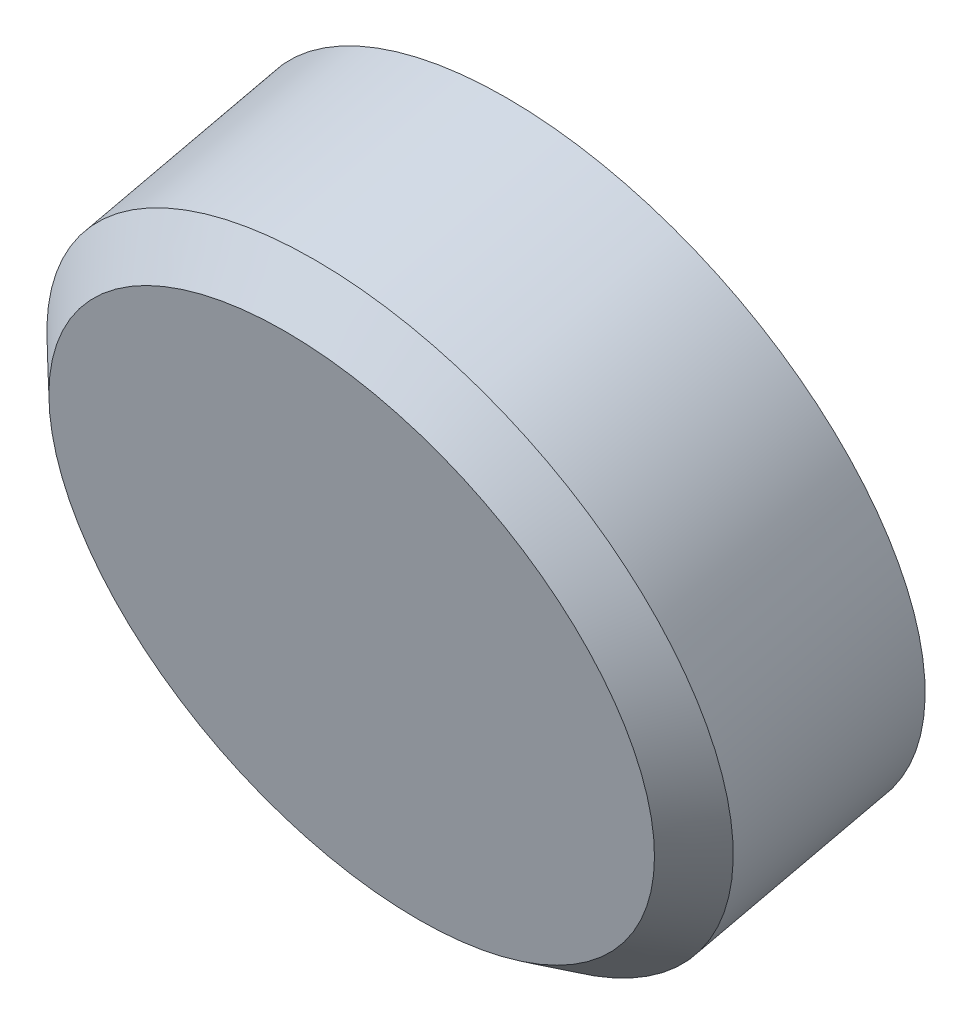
ISO-10303-21;
HEADER;
FILE_DESCRIPTION(('STEP AP214'),'2;1');
FILE_NAME('part.step','',(''),(''),'','','');
FILE_SCHEMA(('AUTOMOTIVE_DESIGN { 1 0 10303 214 1 1 1 1 }'));
ENDSEC;
DATA;
#1=APPLICATION_CONTEXT('core data for automotive mechanical design processes');
#2=APPLICATION_PROTOCOL_DEFINITION('international standard','automotive_design',2000,#1);
#3=PRODUCT_CONTEXT('',#1,'mechanical');
#4=PRODUCT('Part','Part','',(#3));
#5=PRODUCT_RELATED_PRODUCT_CATEGORY('part','',(#4));
#6=PRODUCT_DEFINITION_FORMATION('','',#4);
#7=PRODUCT_DEFINITION_CONTEXT('part definition',#1,'design');
#8=PRODUCT_DEFINITION('design','',#6,#7);
#9=PRODUCT_DEFINITION_SHAPE('','',#8);
#10=(LENGTH_UNIT() NAMED_UNIT(*) SI_UNIT(.MILLI.,.METRE.));
#11=(NAMED_UNIT(*) PLANE_ANGLE_UNIT() SI_UNIT($,.RADIAN.));
#12=(NAMED_UNIT(*) SI_UNIT($,.STERADIAN.) SOLID_ANGLE_UNIT());
#13=UNCERTAINTY_MEASURE_WITH_UNIT(LENGTH_MEASURE(1.E-05),#10,'distance_accuracy_value','');
#14=(GEOMETRIC_REPRESENTATION_CONTEXT(3) GLOBAL_UNCERTAINTY_ASSIGNED_CONTEXT((#13)) GLOBAL_UNIT_ASSIGNED_CONTEXT((#10,
#11,#12)) REPRESENTATION_CONTEXT('',''));
#15=CARTESIAN_POINT('',(0.,0.,0.));
#16=DIRECTION('',(0.,0.,1.));
#17=DIRECTION('',(1.,0.,0.));
#18=AXIS2_PLACEMENT_3D('',#15,#16,#17);
#19=CARTESIAN_POINT('',(4.24215403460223,-22.0762664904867,12.3182328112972));
#20=DIRECTION('',(0.,0.224951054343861,-0.974370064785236));
#21=DIRECTION('',(-1.,0.,0.));
#22=AXIS2_PLACEMENT_3D('',#19,#20,#21);
#23=PLANE('',#22);
#24=CARTESIAN_POINT('',(-0.0178459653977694,-17.9254500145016,13.2765243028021));
#25=DIRECTION('',(0.,0.224951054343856,-0.974370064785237));
#26=DIRECTION('',(0.,0.974370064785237,0.224951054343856));
#27=AXIS2_PLACEMENT_3D('',#24,#25,#26);
#28=CIRCLE('',#27,4.25000000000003);
#29=CARTESIAN_POINT('',(-0.0178459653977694,-13.7843772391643,14.2325662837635));
#30=VERTEX_POINT('',#29);
#31=EDGE_CURVE('E18',#30,#30,#28,.F.);
#32=ORIENTED_EDGE('',*,*,#31,.F.);
#33=EDGE_LOOP('',(#32));
#34=FACE_BOUND('',#33,.T.);
#35=ADVANCED_FACE('F14',(#34),#23,.T.);
#36=CARTESIAN_POINT('',(-3.77784596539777,-22.2639346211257,15.3538185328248));
#37=DIRECTION('',(0.,-0.224951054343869,0.974370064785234));
#38=DIRECTION('',(1.,0.,0.));
#39=AXIS2_PLACEMENT_3D('',#36,#37,#38);
#40=PLANE('',#39);
#41=CARTESIAN_POINT('',(-0.0178459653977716,-18.6003031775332,16.1996344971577));
#42=DIRECTION('',(0.,0.224951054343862,-0.974370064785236));
#43=DIRECTION('',(0.,0.974370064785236,0.224951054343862));
#44=AXIS2_PLACEMENT_3D('',#41,#42,#43);
#45=CIRCLE('',#44,3.74999999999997);
#46=CARTESIAN_POINT('',(-0.0178459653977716,-14.9464154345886,17.0432009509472));
#47=VERTEX_POINT('',#46);
#48=EDGE_CURVE('E22',#47,#47,#45,.T.);
#49=ORIENTED_EDGE('',*,*,#48,.F.);
#50=EDGE_LOOP('',(#49));
#51=FACE_BOUND('',#50,.T.);
#52=ADVANCED_FACE('F36',(#51),#40,.T.);
#53=CARTESIAN_POINT('',(-0.0178459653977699,-18.4878276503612,15.7124494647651));
#54=DIRECTION('',(0.,0.224951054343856,-0.974370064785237));
#55=DIRECTION('',(0.,0.974370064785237,0.224951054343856));
#56=AXIS2_PLACEMENT_3D('',#53,#54,#55);
#57=CYLINDRICAL_SURFACE('',#56,4.25000000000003);
#58=ORIENTED_EDGE('',*,*,#31,.T.);
#59=EDGE_LOOP('',(#58));
#60=FACE_BOUND('',#59,.T.);
#61=CARTESIAN_POINT('',(-0.0178459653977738,-18.4878276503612,15.7124494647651));
#62=DIRECTION('',(0.,-0.224951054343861,0.974370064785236));
#63=DIRECTION('',(0.,-0.974370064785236,-0.224951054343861));
#64=AXIS2_PLACEMENT_3D('',#61,#62,#63);
#65=CIRCLE('',#64,4.24999999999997);
#66=CARTESIAN_POINT('',(-0.0178459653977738,-22.6289004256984,14.7564074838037));
#67=VERTEX_POINT('',#66);
#68=EDGE_CURVE('E10',#67,#67,#65,.T.);
#69=ORIENTED_EDGE('',*,*,#68,.F.);
#70=EDGE_LOOP('',(#69));
#71=FACE_BOUND('',#70,.T.);
#72=ADVANCED_FACE('F32',(#60,#71),#57,.T.);
#73=CARTESIAN_POINT('',(-0.0178459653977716,-18.6003031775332,16.1996344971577));
#74=DIRECTION('',(0.,0.224951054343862,-0.974370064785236));
#75=DIRECTION('',(0.,0.974370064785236,0.224951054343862));
#76=AXIS2_PLACEMENT_3D('',#73,#74,#75);
#77=CONICAL_SURFACE('',#76,3.74999999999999,0.785398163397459);
#78=ORIENTED_EDGE('',*,*,#68,.T.);
#79=EDGE_LOOP('',(#78));
#80=FACE_BOUND('',#79,.T.);
#81=ORIENTED_EDGE('',*,*,#48,.T.);
#82=EDGE_LOOP('',(#81));
#83=FACE_BOUND('',#82,.T.);
#84=ADVANCED_FACE('F16',(#80,#83),#77,.T.);
#85=CLOSED_SHELL('',(#35,#52,#72,#84));
#86=MANIFOLD_SOLID_BREP('B1',#85);
#87=ADVANCED_BREP_SHAPE_REPRESENTATION('',(#18,#86),#14);
#88=SHAPE_DEFINITION_REPRESENTATION(#9,#87);
ENDSEC;
END-ISO-10303-21;
